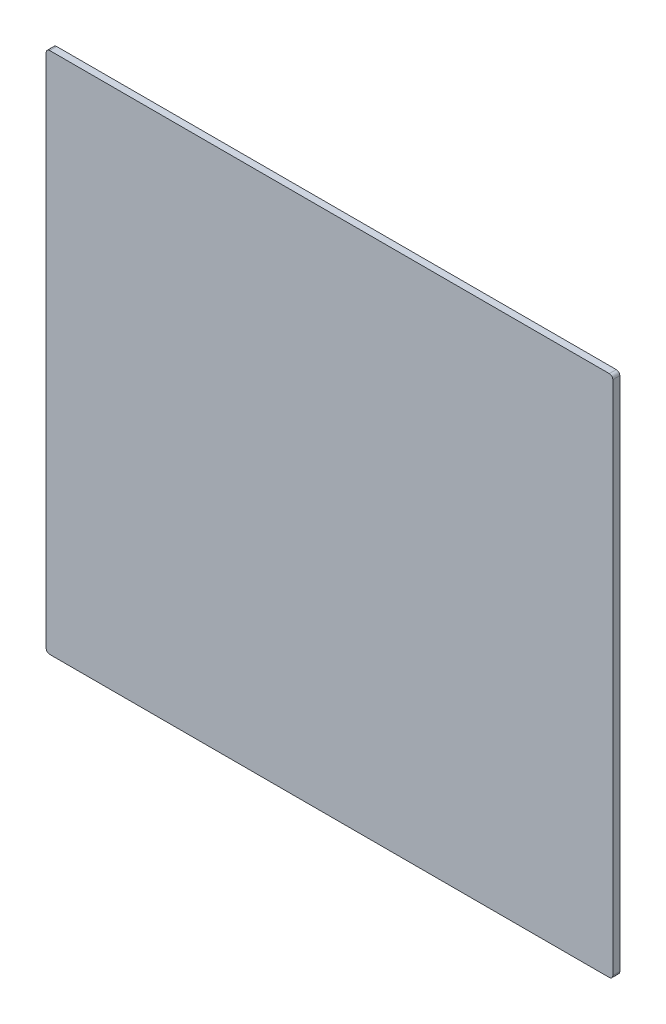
ISO-10303-21;
HEADER;
FILE_DESCRIPTION(('STEP AP214'),'2;1');
FILE_NAME('part.step','',(''),(''),'','','');
FILE_SCHEMA(('AUTOMOTIVE_DESIGN { 1 0 10303 214 1 1 1 1 }'));
ENDSEC;
DATA;
#1=APPLICATION_CONTEXT('core data for automotive mechanical design processes');
#2=APPLICATION_PROTOCOL_DEFINITION('international standard','automotive_design',2000,#1);
#3=PRODUCT_CONTEXT('',#1,'mechanical');
#4=PRODUCT('Part','Part','',(#3));
#5=PRODUCT_RELATED_PRODUCT_CATEGORY('part','',(#4));
#6=PRODUCT_DEFINITION_FORMATION('','',#4);
#7=PRODUCT_DEFINITION_CONTEXT('part definition',#1,'design');
#8=PRODUCT_DEFINITION('design','',#6,#7);
#9=PRODUCT_DEFINITION_SHAPE('','',#8);
#10=(LENGTH_UNIT() NAMED_UNIT(*) SI_UNIT(.MILLI.,.METRE.));
#11=(NAMED_UNIT(*) PLANE_ANGLE_UNIT() SI_UNIT($,.RADIAN.));
#12=(NAMED_UNIT(*) SI_UNIT($,.STERADIAN.) SOLID_ANGLE_UNIT());
#13=UNCERTAINTY_MEASURE_WITH_UNIT(LENGTH_MEASURE(1.E-05),#10,'distance_accuracy_value','');
#14=(GEOMETRIC_REPRESENTATION_CONTEXT(3) GLOBAL_UNCERTAINTY_ASSIGNED_CONTEXT((#13)) GLOBAL_UNIT_ASSIGNED_CONTEXT((#10,
#11,#12)) REPRESENTATION_CONTEXT('',''));
#15=CARTESIAN_POINT('',(0.,0.,0.));
#16=DIRECTION('',(0.,0.,1.));
#17=DIRECTION('',(1.,0.,0.));
#18=AXIS2_PLACEMENT_3D('',#15,#16,#17);
#19=CARTESIAN_POINT('',(0.,0.,0.));
#20=DIRECTION('',(0.,0.,-1.));
#21=DIRECTION('',(-1.,0.,0.));
#22=AXIS2_PLACEMENT_3D('',#19,#20,#21);
#23=PLANE('',#22);
#24=DIRECTION('',(0.,-1.,0.));
#25=VECTOR('',#24,1.);
#26=CARTESIAN_POINT('',(304.511369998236,109.286248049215,0.));
#27=LINE('',#26,#25);
#28=CARTESIAN_POINT('',(304.511369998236,107.286248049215,0.));
#29=VERTEX_POINT('',#28);
#30=CARTESIAN_POINT('',(304.511369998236,-188.713751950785,0.));
#31=VERTEX_POINT('',#30);
#32=EDGE_CURVE('E110',#29,#31,#27,.T.);
#33=ORIENTED_EDGE('',*,*,#32,.T.);
#34=CARTESIAN_POINT('',(302.511369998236,-188.713751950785,0.));
#35=DIRECTION('',(0.,0.,-1.));
#36=DIRECTION('',(-1.,0.,0.));
#37=AXIS2_PLACEMENT_3D('',#34,#35,#36);
#38=CIRCLE('',#37,2.);
#39=CARTESIAN_POINT('',(302.511369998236,-190.713751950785,0.));
#40=VERTEX_POINT('',#39);
#41=EDGE_CURVE('E111',#40,#31,#38,.F.);
#42=ORIENTED_EDGE('',*,*,#41,.F.);
#43=DIRECTION('',(-1.,0.,0.));
#44=VECTOR('',#43,1.);
#45=CARTESIAN_POINT('',(304.511369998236,-190.713751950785,0.));
#46=LINE('',#45,#44);
#47=CARTESIAN_POINT('',(-18.4886300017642,-190.713751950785,0.));
#48=VERTEX_POINT('',#47);
#49=EDGE_CURVE('E105',#40,#48,#46,.T.);
#50=ORIENTED_EDGE('',*,*,#49,.T.);
#51=CARTESIAN_POINT('',(-18.4886300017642,-188.713751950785,0.));
#52=DIRECTION('',(0.,0.,-1.));
#53=DIRECTION('',(-1.,0.,0.));
#54=AXIS2_PLACEMENT_3D('',#51,#52,#53);
#55=CIRCLE('',#54,2.);
#56=CARTESIAN_POINT('',(-20.4886300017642,-188.713751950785,0.));
#57=VERTEX_POINT('',#56);
#58=EDGE_CURVE('E108',#57,#48,#55,.F.);
#59=ORIENTED_EDGE('',*,*,#58,.F.);
#60=DIRECTION('',(0.,1.,0.));
#61=VECTOR('',#60,1.);
#62=CARTESIAN_POINT('',(-20.4886300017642,109.286248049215,0.));
#63=LINE('',#62,#61);
#64=CARTESIAN_POINT('',(-20.4886300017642,107.286248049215,0.));
#65=VERTEX_POINT('',#64);
#66=EDGE_CURVE('E84',#57,#65,#63,.T.);
#67=ORIENTED_EDGE('',*,*,#66,.T.);
#68=CARTESIAN_POINT('',(-18.4886300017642,107.286248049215,0.));
#69=DIRECTION('',(0.,0.,-1.));
#70=DIRECTION('',(-1.,0.,0.));
#71=AXIS2_PLACEMENT_3D('',#68,#69,#70);
#72=CIRCLE('',#71,2.);
#73=CARTESIAN_POINT('',(-18.4886300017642,109.286248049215,0.));
#74=VERTEX_POINT('',#73);
#75=EDGE_CURVE('E20',#74,#65,#72,.F.);
#76=ORIENTED_EDGE('',*,*,#75,.F.);
#77=DIRECTION('',(1.,0.,0.));
#78=VECTOR('',#77,1.);
#79=CARTESIAN_POINT('',(304.511369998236,109.286248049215,0.));
#80=LINE('',#79,#78);
#81=CARTESIAN_POINT('',(302.511369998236,109.286248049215,0.));
#82=VERTEX_POINT('',#81);
#83=EDGE_CURVE('E82',#74,#82,#80,.T.);
#84=ORIENTED_EDGE('',*,*,#83,.T.);
#85=CARTESIAN_POINT('',(302.511369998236,107.286248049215,0.));
#86=DIRECTION('',(0.,0.,-1.));
#87=DIRECTION('',(-1.,0.,0.));
#88=AXIS2_PLACEMENT_3D('',#85,#86,#87);
#89=CIRCLE('',#88,2.);
#90=EDGE_CURVE('E95',#29,#82,#89,.F.);
#91=ORIENTED_EDGE('',*,*,#90,.F.);
#92=EDGE_LOOP('',(#33,#42,#50,#59,#67,#76,#84,#91));
#93=FACE_BOUND('',#92,.T.);
#94=ADVANCED_FACE('F17',(#93),#23,.T.);
#95=CARTESIAN_POINT('',(-18.4886300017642,107.286248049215,4.));
#96=DIRECTION('',(0.,0.,-1.));
#97=DIRECTION('',(-1.,0.,0.));
#98=AXIS2_PLACEMENT_3D('',#95,#96,#97);
#99=CYLINDRICAL_SURFACE('',#98,2.);
#100=ORIENTED_EDGE('',*,*,#75,.T.);
#101=DIRECTION('',(0.,0.,1.));
#102=VECTOR('',#101,1.);
#103=CARTESIAN_POINT('',(-20.4886300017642,107.286248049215,4.));
#104=LINE('',#103,#102);
#105=CARTESIAN_POINT('',(-20.4886300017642,107.286248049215,4.));
#106=VERTEX_POINT('',#105);
#107=EDGE_CURVE('E137',#65,#106,#104,.T.);
#108=ORIENTED_EDGE('',*,*,#107,.T.);
#109=CARTESIAN_POINT('',(-18.4886300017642,107.286248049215,4.));
#110=DIRECTION('',(0.,0.,-1.));
#111=DIRECTION('',(-1.,0.,0.));
#112=AXIS2_PLACEMENT_3D('',#109,#110,#111);
#113=CIRCLE('',#112,2.);
#114=CARTESIAN_POINT('',(-18.4886300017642,109.286248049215,4.));
#115=VERTEX_POINT('',#114);
#116=EDGE_CURVE('E99',#106,#115,#113,.T.);
#117=ORIENTED_EDGE('',*,*,#116,.T.);
#118=DIRECTION('',(0.,0.,1.));
#119=VECTOR('',#118,1.);
#120=CARTESIAN_POINT('',(-18.4886300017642,109.286248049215,4.));
#121=LINE('',#120,#119);
#122=EDGE_CURVE('E89',#115,#74,#121,.F.);
#123=ORIENTED_EDGE('',*,*,#122,.T.);
#124=EDGE_LOOP('',(#100,#108,#117,#123));
#125=FACE_BOUND('',#124,.T.);
#126=ADVANCED_FACE('F98',(#125),#99,.T.);
#127=CARTESIAN_POINT('',(304.511369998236,109.286248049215,4.));
#128=DIRECTION('',(0.,-1.,0.));
#129=DIRECTION('',(1.,0.,0.));
#130=AXIS2_PLACEMENT_3D('',#127,#128,#129);
#131=PLANE('',#130);
#132=ORIENTED_EDGE('',*,*,#122,.F.);
#133=DIRECTION('',(-1.,0.,0.));
#134=VECTOR('',#133,1.);
#135=CARTESIAN_POINT('',(0.,109.286248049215,4.));
#136=LINE('',#135,#134);
#137=CARTESIAN_POINT('',(302.511369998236,109.286248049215,4.));
#138=VERTEX_POINT('',#137);
#139=EDGE_CURVE('E124',#115,#138,#136,.F.);
#140=ORIENTED_EDGE('',*,*,#139,.T.);
#141=DIRECTION('',(0.,0.,-1.));
#142=VECTOR('',#141,1.);
#143=CARTESIAN_POINT('',(302.511369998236,109.286248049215,4.));
#144=LINE('',#143,#142);
#145=EDGE_CURVE('E94',#82,#138,#144,.F.);
#146=ORIENTED_EDGE('',*,*,#145,.F.);
#147=ORIENTED_EDGE('',*,*,#83,.F.);
#148=EDGE_LOOP('',(#132,#140,#146,#147));
#149=FACE_BOUND('',#148,.T.);
#150=ADVANCED_FACE('F91',(#149),#131,.F.);
#151=CARTESIAN_POINT('',(302.511369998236,107.286248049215,4.));
#152=DIRECTION('',(0.,0.,-1.));
#153=DIRECTION('',(-1.,0.,0.));
#154=AXIS2_PLACEMENT_3D('',#151,#152,#153);
#155=CYLINDRICAL_SURFACE('',#154,2.);
#156=ORIENTED_EDGE('',*,*,#90,.T.);
#157=ORIENTED_EDGE('',*,*,#145,.T.);
#158=CARTESIAN_POINT('',(302.511369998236,107.286248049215,4.));
#159=DIRECTION('',(0.,0.,-1.));
#160=DIRECTION('',(-1.,0.,0.));
#161=AXIS2_PLACEMENT_3D('',#158,#159,#160);
#162=CIRCLE('',#161,2.);
#163=CARTESIAN_POINT('',(304.511369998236,107.286248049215,4.));
#164=VERTEX_POINT('',#163);
#165=EDGE_CURVE('E121',#138,#164,#162,.T.);
#166=ORIENTED_EDGE('',*,*,#165,.T.);
#167=DIRECTION('',(0.,0.,1.));
#168=VECTOR('',#167,1.);
#169=CARTESIAN_POINT('',(304.511369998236,107.286248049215,4.));
#170=LINE('',#169,#168);
#171=EDGE_CURVE('E112',#164,#29,#170,.F.);
#172=ORIENTED_EDGE('',*,*,#171,.T.);
#173=EDGE_LOOP('',(#156,#157,#166,#172));
#174=FACE_BOUND('',#173,.T.);
#175=ADVANCED_FACE('F160',(#174),#155,.T.);
#176=CARTESIAN_POINT('',(304.511369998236,109.286248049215,4.));
#177=DIRECTION('',(-1.,0.,0.));
#178=DIRECTION('',(0.,-1.,0.));
#179=AXIS2_PLACEMENT_3D('',#176,#177,#178);
#180=PLANE('',#179);
#181=DIRECTION('',(0.,0.,-1.));
#182=VECTOR('',#181,1.);
#183=CARTESIAN_POINT('',(304.511369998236,-188.713751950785,4.));
#184=LINE('',#183,#182);
#185=CARTESIAN_POINT('',(304.511369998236,-188.713751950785,4.));
#186=VERTEX_POINT('',#185);
#187=EDGE_CURVE('E128',#31,#186,#184,.F.);
#188=ORIENTED_EDGE('',*,*,#187,.F.);
#189=ORIENTED_EDGE('',*,*,#32,.F.);
#190=ORIENTED_EDGE('',*,*,#171,.F.);
#191=DIRECTION('',(0.,1.,0.));
#192=VECTOR('',#191,1.);
#193=CARTESIAN_POINT('',(304.511369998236,0.,4.));
#194=LINE('',#193,#192);
#195=EDGE_CURVE('E120',#164,#186,#194,.F.);
#196=ORIENTED_EDGE('',*,*,#195,.T.);
#197=EDGE_LOOP('',(#188,#189,#190,#196));
#198=FACE_BOUND('',#197,.T.);
#199=ADVANCED_FACE('F159',(#198),#180,.F.);
#200=CARTESIAN_POINT('',(302.511369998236,-188.713751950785,4.));
#201=DIRECTION('',(0.,0.,-1.));
#202=DIRECTION('',(-1.,0.,0.));
#203=AXIS2_PLACEMENT_3D('',#200,#201,#202);
#204=CYLINDRICAL_SURFACE('',#203,2.);
#205=ORIENTED_EDGE('',*,*,#41,.T.);
#206=ORIENTED_EDGE('',*,*,#187,.T.);
#207=CARTESIAN_POINT('',(302.511369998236,-188.713751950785,4.));
#208=DIRECTION('',(0.,0.,-1.));
#209=DIRECTION('',(-1.,0.,0.));
#210=AXIS2_PLACEMENT_3D('',#207,#208,#209);
#211=CIRCLE('',#210,2.);
#212=CARTESIAN_POINT('',(302.511369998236,-190.713751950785,4.));
#213=VERTEX_POINT('',#212);
#214=EDGE_CURVE('E117',#186,#213,#211,.T.);
#215=ORIENTED_EDGE('',*,*,#214,.T.);
#216=DIRECTION('',(0.,0.,1.));
#217=VECTOR('',#216,1.);
#218=CARTESIAN_POINT('',(302.511369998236,-190.713751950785,4.));
#219=LINE('',#218,#217);
#220=EDGE_CURVE('E109',#213,#40,#219,.F.);
#221=ORIENTED_EDGE('',*,*,#220,.T.);
#222=EDGE_LOOP('',(#205,#206,#215,#221));
#223=FACE_BOUND('',#222,.T.);
#224=ADVANCED_FACE('F155',(#223),#204,.T.);
#225=CARTESIAN_POINT('',(304.511369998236,-190.713751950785,4.));
#226=DIRECTION('',(0.,1.,0.));
#227=DIRECTION('',(-1.,0.,0.));
#228=AXIS2_PLACEMENT_3D('',#225,#226,#227);
#229=PLANE('',#228);
#230=DIRECTION('',(0.,0.,-1.));
#231=VECTOR('',#230,1.);
#232=CARTESIAN_POINT('',(-18.4886300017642,-190.713751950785,4.));
#233=LINE('',#232,#231);
#234=CARTESIAN_POINT('',(-18.4886300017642,-190.713751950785,4.));
#235=VERTEX_POINT('',#234);
#236=EDGE_CURVE('E127',#48,#235,#233,.F.);
#237=ORIENTED_EDGE('',*,*,#236,.F.);
#238=ORIENTED_EDGE('',*,*,#49,.F.);
#239=ORIENTED_EDGE('',*,*,#220,.F.);
#240=DIRECTION('',(-1.,0.,0.));
#241=VECTOR('',#240,1.);
#242=CARTESIAN_POINT('',(0.,-190.713751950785,4.));
#243=LINE('',#242,#241);
#244=EDGE_CURVE('E116',#213,#235,#243,.T.);
#245=ORIENTED_EDGE('',*,*,#244,.T.);
#246=EDGE_LOOP('',(#237,#238,#239,#245));
#247=FACE_BOUND('',#246,.T.);
#248=ADVANCED_FACE('F147',(#247),#229,.F.);
#249=CARTESIAN_POINT('',(-18.4886300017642,-188.713751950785,4.));
#250=DIRECTION('',(0.,0.,-1.));
#251=DIRECTION('',(-1.,0.,0.));
#252=AXIS2_PLACEMENT_3D('',#249,#250,#251);
#253=CYLINDRICAL_SURFACE('',#252,2.);
#254=ORIENTED_EDGE('',*,*,#58,.T.);
#255=ORIENTED_EDGE('',*,*,#236,.T.);
#256=CARTESIAN_POINT('',(-18.4886300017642,-188.713751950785,4.));
#257=DIRECTION('',(0.,0.,-1.));
#258=DIRECTION('',(-1.,0.,0.));
#259=AXIS2_PLACEMENT_3D('',#256,#257,#258);
#260=CIRCLE('',#259,2.);
#261=CARTESIAN_POINT('',(-20.4886300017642,-188.713751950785,4.));
#262=VERTEX_POINT('',#261);
#263=EDGE_CURVE('E26',#235,#262,#260,.T.);
#264=ORIENTED_EDGE('',*,*,#263,.T.);
#265=DIRECTION('',(0.,0.,1.));
#266=VECTOR('',#265,1.);
#267=CARTESIAN_POINT('',(-20.4886300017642,-188.713751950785,4.));
#268=LINE('',#267,#266);
#269=EDGE_CURVE('E34',#262,#57,#268,.F.);
#270=ORIENTED_EDGE('',*,*,#269,.T.);
#271=EDGE_LOOP('',(#254,#255,#264,#270));
#272=FACE_BOUND('',#271,.T.);
#273=ADVANCED_FACE('F176',(#272),#253,.T.);
#274=CARTESIAN_POINT('',(-20.4886300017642,109.286248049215,4.));
#275=DIRECTION('',(1.,0.,0.));
#276=DIRECTION('',(0.,1.,0.));
#277=AXIS2_PLACEMENT_3D('',#274,#275,#276);
#278=PLANE('',#277);
#279=ORIENTED_EDGE('',*,*,#269,.F.);
#280=DIRECTION('',(0.,1.,0.));
#281=VECTOR('',#280,1.);
#282=CARTESIAN_POINT('',(-20.4886300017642,0.,4.));
#283=LINE('',#282,#281);
#284=EDGE_CURVE('E11',#262,#106,#283,.T.);
#285=ORIENTED_EDGE('',*,*,#284,.T.);
#286=ORIENTED_EDGE('',*,*,#107,.F.);
#287=ORIENTED_EDGE('',*,*,#66,.F.);
#288=EDGE_LOOP('',(#279,#285,#286,#287));
#289=FACE_BOUND('',#288,.T.);
#290=ADVANCED_FACE('F171',(#289),#278,.F.);
#291=CARTESIAN_POINT('',(0.,0.,4.));
#292=DIRECTION('',(0.,0.,-1.));
#293=DIRECTION('',(-1.,0.,0.));
#294=AXIS2_PLACEMENT_3D('',#291,#292,#293);
#295=PLANE('',#294);
#296=ORIENTED_EDGE('',*,*,#263,.F.);
#297=ORIENTED_EDGE('',*,*,#244,.F.);
#298=ORIENTED_EDGE('',*,*,#214,.F.);
#299=ORIENTED_EDGE('',*,*,#195,.F.);
#300=ORIENTED_EDGE('',*,*,#165,.F.);
#301=ORIENTED_EDGE('',*,*,#139,.F.);
#302=ORIENTED_EDGE('',*,*,#116,.F.);
#303=ORIENTED_EDGE('',*,*,#284,.F.);
#304=EDGE_LOOP('',(#296,#297,#298,#299,#300,#301,#302,#303));
#305=FACE_BOUND('',#304,.T.);
#306=ADVANCED_FACE('F152',(#305),#295,.F.);
#307=CLOSED_SHELL('',(#94,#126,#150,#175,#199,#224,#248,#273,#290,#306));
#308=MANIFOLD_SOLID_BREP('B1',#307);
#309=ADVANCED_BREP_SHAPE_REPRESENTATION('',(#18,#308),#14);
#310=SHAPE_DEFINITION_REPRESENTATION(#9,#309);
ENDSEC;
END-ISO-10303-21;
